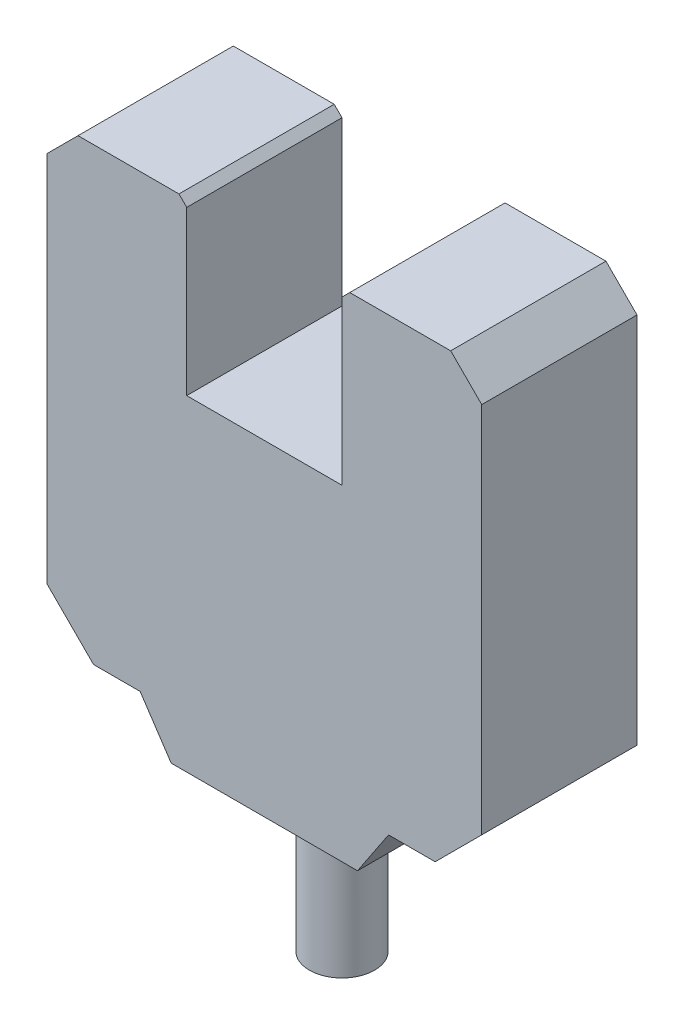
from build123d import *

# Parameters (mm, degrees)
EXTRUDE_1_DEPTH = 10
SKETCH_2_R      = 2.1
EXTRUDE_2_DEPTH = 10


with BuildPart() as part:
    # Sketch 1 → Extrude 1 (new body)
    with BuildSketch(Plane.XY):
        Polygon((0, 6), (0, 30), (2, 32), (8.5, 32), (9, 31.5), (9, 21), (19, 21), (19, 31.5), (19.5, 32), (26, 32), (28, 30), (28, 6), (25, 3), (22, 3), (20, 0), (14, 0), (8, 0), (6, 3), (3, 3), align=None)
    extrude(amount=EXTRUDE_1_DEPTH)

    # Sketch 2 → Extrude 2 (add)
    with BuildSketch(Plane.XZ):
        with Locations(Location((14, 5, 0), (0, 0, 180))):
            Circle(SKETCH_2_R)
    extrude(amount=EXTRUDE_2_DEPTH)


solid = part.part
